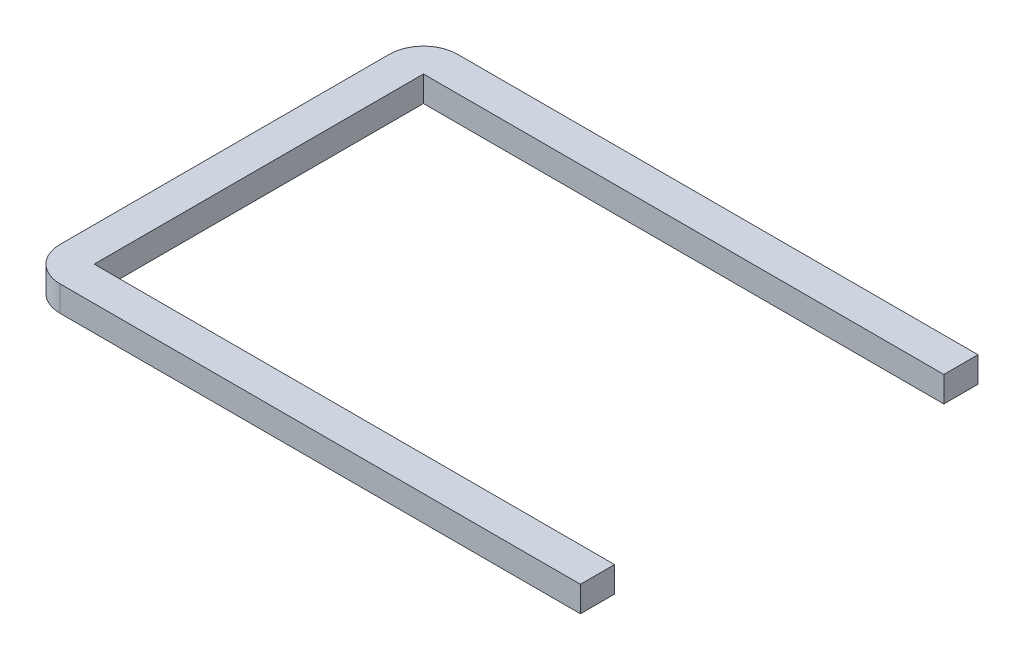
from build123d import *

# Parameters (mm, degrees)
EXTRUDE_THIN1_DEPTH          = 7.5
FILLET1_R                    = 10
SKETCH3_W                    = 50
SKETCH3_H                    = 5
CUT_EXTRUDE2_DEPTH           = 2.1
CUT_EXTRUDE2_DRAFT           = -45
SKETCH3_W_2                  = 5
SKETCH3_H_2                  = 50
CUT_EXTRUDE2_PROFILE_2_DEPTH = 2.1
CUT_EXTRUDE2_PROFILE_2_DRAFT = -45
CUT_EXTRUDE2_PROFILE_3_DEPTH = 2.1
CUT_EXTRUDE2_PROFILE_3_DRAFT = -45


with BuildPart() as part:
    # Sketch2 → Extrude-Thin1 (new body)
    with BuildSketch(Plane(origin=(0, 0, 0), x_dir=(1, 0, 0), z_dir=(0, 1, 0))):
        Polygon((162.5, 0), (0, 0), (0, 116.5), (162.5, 116.5), (162.5, 106.5), (10, 106.5), (10, 10), (162.5, 10), align=None)
    extrude(amount=EXTRUDE_THIN1_DEPTH)

    # Fillet1
    fillet1_edges = [part.edges().sort_by_distance(p)[0] for p in [
        (0, 3.75, 0),
        (0, 3.75, -116.5),
    ]]
    fillet(fillet1_edges, radius=FILLET1_R)


with BuildPart() as cut_extrude2_tool:
    # Sketch3 → Cut-Extrude2 (with draft: the straight prism first)
    with BuildSketch(Plane.XZ):
        with Locations((97.5, -5)):
            Rectangle(SKETCH3_W, SKETCH3_H)
    extrude(amount=-CUT_EXTRUDE2_DEPTH)
    # Cut-Extrude2: the draft: its side faces are tilted about the plane it starts from
    cut_extrude2_sides = [cut_extrude2_tool.faces().sort_by_distance(p)[0] for p in [
        (72.5, 1.05, -5),
        (97.5, 1.05, -7.5),
        (122.5, 1.05, -5),
        (97.5, 1.05, -2.5),
    ]]
    draft(cut_extrude2_sides, Plane.XZ, CUT_EXTRUDE2_DRAFT)


with BuildPart() as part_1:
    add(part.part)

    # Cut-Extrude2: cut by cut_extrude2_tool
    add(cut_extrude2_tool.part, mode=Mode.SUBTRACT)


with BuildPart() as cut_extrude2_profile_2_tool:
    # Sketch3 → Cut-Extrude2 profile 2 (with draft: the straight prism first)
    with BuildSketch(Plane.XZ):
        with Locations((5, -58.25)):
            Rectangle(SKETCH3_W_2, SKETCH3_H_2)
    extrude(amount=-CUT_EXTRUDE2_PROFILE_2_DEPTH)
    # Cut-Extrude2 profile 2: the draft: its side faces are tilted about the plane it starts from
    cut_extrude2_profile_2_sides = [cut_extrude2_profile_2_tool.faces().sort_by_distance(p)[0] for p in [
        (2.5, 1.05, -58.25),
        (5, 1.05, -83.25),
        (7.5, 1.05, -58.25),
        (5, 1.05, -33.25),
    ]]
    draft(cut_extrude2_profile_2_sides, Plane.XZ, CUT_EXTRUDE2_PROFILE_2_DRAFT)


with BuildPart() as part_2:
    add(part_1.part)

    # Cut-Extrude2 profile 2: cut by cut_extrude2_profile_2_tool
    add(cut_extrude2_profile_2_tool.part, mode=Mode.SUBTRACT)


with BuildPart() as cut_extrude2_profile_3_tool:
    # Sketch3 → Cut-Extrude2 profile 3 (with draft: the straight prism first)
    with BuildSketch(Plane.XZ):
        with Locations((97.5, -111.5)):
            Rectangle(SKETCH3_W, SKETCH3_H)
    extrude(amount=-CUT_EXTRUDE2_PROFILE_3_DEPTH)
    # Cut-Extrude2 profile 3: the draft: its side faces are tilted about the plane it starts from
    cut_extrude2_profile_3_sides = [cut_extrude2_profile_3_tool.faces().sort_by_distance(p)[0] for p in [
        (72.5, 1.05, -111.5),
        (97.5, 1.05, -114),
        (122.5, 1.05, -111.5),
        (97.5, 1.05, -109),
    ]]
    draft(cut_extrude2_profile_3_sides, Plane.XZ, CUT_EXTRUDE2_PROFILE_3_DRAFT)


with BuildPart() as part_3:
    add(part_2.part)

    # Cut-Extrude2 profile 3: cut by cut_extrude2_profile_3_tool
    add(cut_extrude2_profile_3_tool.part, mode=Mode.SUBTRACT)


solid = part_3.part
